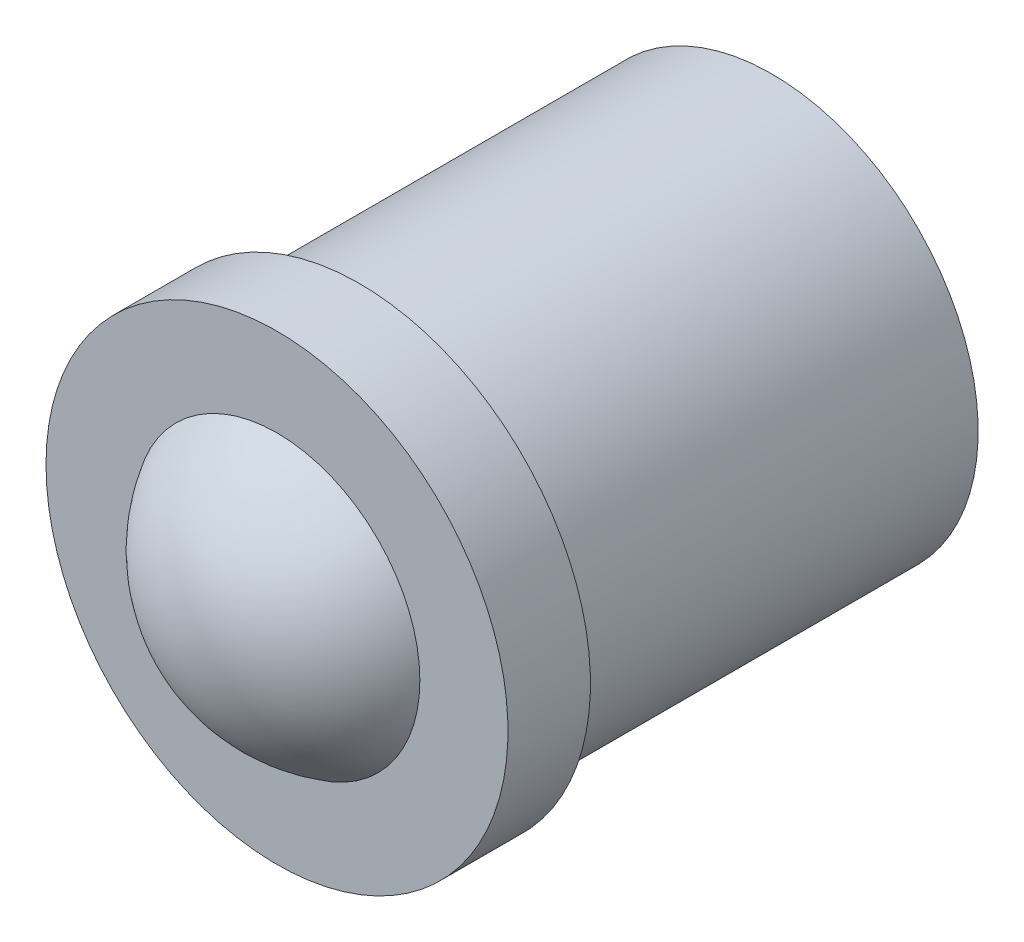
ISO-10303-21;
HEADER;
FILE_DESCRIPTION(('STEP AP214'),'2;1');
FILE_NAME('part.step','',(''),(''),'','','');
FILE_SCHEMA(('AUTOMOTIVE_DESIGN { 1 0 10303 214 1 1 1 1 }'));
ENDSEC;
DATA;
#1=APPLICATION_CONTEXT('core data for automotive mechanical design processes');
#2=APPLICATION_PROTOCOL_DEFINITION('international standard','automotive_design',2000,#1);
#3=PRODUCT_CONTEXT('',#1,'mechanical');
#4=PRODUCT('Part','Part','',(#3));
#5=PRODUCT_RELATED_PRODUCT_CATEGORY('part','',(#4));
#6=PRODUCT_DEFINITION_FORMATION('','',#4);
#7=PRODUCT_DEFINITION_CONTEXT('part definition',#1,'design');
#8=PRODUCT_DEFINITION('design','',#6,#7);
#9=PRODUCT_DEFINITION_SHAPE('','',#8);
#10=(LENGTH_UNIT() NAMED_UNIT(*) SI_UNIT(.MILLI.,.METRE.));
#11=(NAMED_UNIT(*) PLANE_ANGLE_UNIT() SI_UNIT($,.RADIAN.));
#12=(NAMED_UNIT(*) SI_UNIT($,.STERADIAN.) SOLID_ANGLE_UNIT());
#13=UNCERTAINTY_MEASURE_WITH_UNIT(LENGTH_MEASURE(1.E-05),#10,'distance_accuracy_value','');
#14=(GEOMETRIC_REPRESENTATION_CONTEXT(3) GLOBAL_UNCERTAINTY_ASSIGNED_CONTEXT((#13)) GLOBAL_UNIT_ASSIGNED_CONTEXT((#10,
#11,#12)) REPRESENTATION_CONTEXT('',''));
#15=CARTESIAN_POINT('',(0.,0.,0.));
#16=DIRECTION('',(0.,0.,1.));
#17=DIRECTION('',(1.,0.,0.));
#18=AXIS2_PLACEMENT_3D('',#15,#16,#17);
#19=CARTESIAN_POINT('',(0.,0.,0.));
#20=DIRECTION('',(-1.,0.,0.));
#21=DIRECTION('',(0.,0.,-1.));
#22=AXIS2_PLACEMENT_3D('',#19,#20,#21);
#23=SPHERICAL_SURFACE('',#22,2.);
#24=CARTESIAN_POINT('',(0.,0.,0.));
#25=DIRECTION('',(0.,0.,1.));
#26=DIRECTION('',(-1.,0.,0.));
#27=AXIS2_PLACEMENT_3D('',#24,#25,#26);
#28=SPHERICAL_SURFACE('',#27,2.);
#29=CARTESIAN_POINT('',(0.,0.,1.));
#30=DIRECTION('',(0.,0.,1.));
#31=DIRECTION('',(-1.,0.,0.));
#32=AXIS2_PLACEMENT_3D('',#29,#30,#31);
#33=CIRCLE('',#32,1.73205080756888);
#34=CARTESIAN_POINT('',(-1.73205080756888,0.,1.));
#35=VERTEX_POINT('',#34);
#36=EDGE_CURVE('E31',#35,#35,#33,.T.);
#37=ORIENTED_EDGE('',*,*,#36,.T.);
#38=EDGE_LOOP('',(#37));
#39=FACE_BOUND('',#38,.T.);
#40=ADVANCED_FACE('F12',(#39),#28,.T.);
#41=CARTESIAN_POINT('',(0.,0.,-5.));
#42=DIRECTION('',(0.,0.,1.));
#43=DIRECTION('',(-1.,0.,0.));
#44=AXIS2_PLACEMENT_3D('',#41,#42,#43);
#45=PLANE('',#44);
#46=CARTESIAN_POINT('',(0.,0.,-5.));
#47=DIRECTION('',(0.,0.,1.));
#48=DIRECTION('',(-1.,0.,0.));
#49=AXIS2_PLACEMENT_3D('',#46,#47,#48);
#50=CIRCLE('',#49,2.5);
#51=CARTESIAN_POINT('',(-2.5,0.,-5.));
#52=VERTEX_POINT('',#51);
#53=EDGE_CURVE('E8',#52,#52,#50,.T.);
#54=ORIENTED_EDGE('',*,*,#53,.F.);
#55=EDGE_LOOP('',(#54));
#56=FACE_BOUND('',#55,.T.);
#57=ADVANCED_FACE('F56',(#56),#45,.F.);
#58=CARTESIAN_POINT('',(0.,0.,2.));
#59=DIRECTION('',(0.,0.,1.));
#60=DIRECTION('',(-1.,0.,0.));
#61=AXIS2_PLACEMENT_3D('',#58,#59,#60);
#62=CYLINDRICAL_SURFACE('',#61,2.5);
#63=CARTESIAN_POINT('',(0.,0.,0.));
#64=DIRECTION('',(0.,0.,1.));
#65=DIRECTION('',(-1.,0.,0.));
#66=AXIS2_PLACEMENT_3D('',#63,#64,#65);
#67=CIRCLE('',#66,2.5);
#68=CARTESIAN_POINT('',(-2.5,0.,0.));
#69=VERTEX_POINT('',#68);
#70=EDGE_CURVE('E18',#69,#69,#67,.T.);
#71=ORIENTED_EDGE('',*,*,#70,.F.);
#72=EDGE_LOOP('',(#71));
#73=FACE_BOUND('',#72,.T.);
#74=ORIENTED_EDGE('',*,*,#53,.T.);
#75=EDGE_LOOP('',(#74));
#76=FACE_BOUND('',#75,.T.);
#77=ADVANCED_FACE('F50',(#73,#76),#62,.T.);
#78=CARTESIAN_POINT('',(0.,-2.5,0.));
#79=DIRECTION('',(0.,0.,1.));
#80=DIRECTION('',(-1.,0.,0.));
#81=AXIS2_PLACEMENT_3D('',#78,#79,#80);
#82=PLANE('',#81);
#83=CARTESIAN_POINT('',(0.,0.,0.));
#84=DIRECTION('',(0.,0.,1.));
#85=DIRECTION('',(-1.,0.,0.));
#86=AXIS2_PLACEMENT_3D('',#83,#84,#85);
#87=CIRCLE('',#86,2.8);
#88=CARTESIAN_POINT('',(-2.8,0.,0.));
#89=VERTEX_POINT('',#88);
#90=EDGE_CURVE('E22',#89,#89,#87,.T.);
#91=ORIENTED_EDGE('',*,*,#90,.F.);
#92=EDGE_LOOP('',(#91));
#93=FACE_BOUND('',#92,.T.);
#94=ORIENTED_EDGE('',*,*,#70,.T.);
#95=EDGE_LOOP('',(#94));
#96=FACE_BOUND('',#95,.T.);
#97=ADVANCED_FACE('F45',(#93,#96),#82,.F.);
#98=CARTESIAN_POINT('',(0.,0.,2.));
#99=DIRECTION('',(0.,0.,1.));
#100=DIRECTION('',(-1.,0.,0.));
#101=AXIS2_PLACEMENT_3D('',#98,#99,#100);
#102=CYLINDRICAL_SURFACE('',#101,2.8);
#103=CARTESIAN_POINT('',(0.,0.,1.));
#104=DIRECTION('',(0.,0.,1.));
#105=DIRECTION('',(-1.,0.,0.));
#106=AXIS2_PLACEMENT_3D('',#103,#104,#105);
#107=CIRCLE('',#106,2.8);
#108=CARTESIAN_POINT('',(-2.8,0.,1.));
#109=VERTEX_POINT('',#108);
#110=EDGE_CURVE('E26',#109,#109,#107,.T.);
#111=ORIENTED_EDGE('',*,*,#110,.F.);
#112=EDGE_LOOP('',(#111));
#113=FACE_BOUND('',#112,.T.);
#114=ORIENTED_EDGE('',*,*,#90,.T.);
#115=EDGE_LOOP('',(#114));
#116=FACE_BOUND('',#115,.T.);
#117=ADVANCED_FACE('F39',(#113,#116),#102,.T.);
#118=CARTESIAN_POINT('',(0.,-2.8,1.));
#119=DIRECTION('',(0.,0.,-1.));
#120=DIRECTION('',(1.,0.,0.));
#121=AXIS2_PLACEMENT_3D('',#118,#119,#120);
#122=PLANE('',#121);
#123=ORIENTED_EDGE('',*,*,#36,.F.);
#124=EDGE_LOOP('',(#123));
#125=FACE_BOUND('',#124,.T.);
#126=ORIENTED_EDGE('',*,*,#110,.T.);
#127=EDGE_LOOP('',(#126));
#128=FACE_BOUND('',#127,.T.);
#129=ADVANCED_FACE('F36',(#125,#128),#122,.F.);
#130=CLOSED_SHELL('',(#40,#57,#77,#97,#117,#129));
#131=MANIFOLD_SOLID_BREP('B1',#130);
#132=ADVANCED_BREP_SHAPE_REPRESENTATION('',(#18,#131),#14);
#133=SHAPE_DEFINITION_REPRESENTATION(#9,#132);
ENDSEC;
END-ISO-10303-21;
